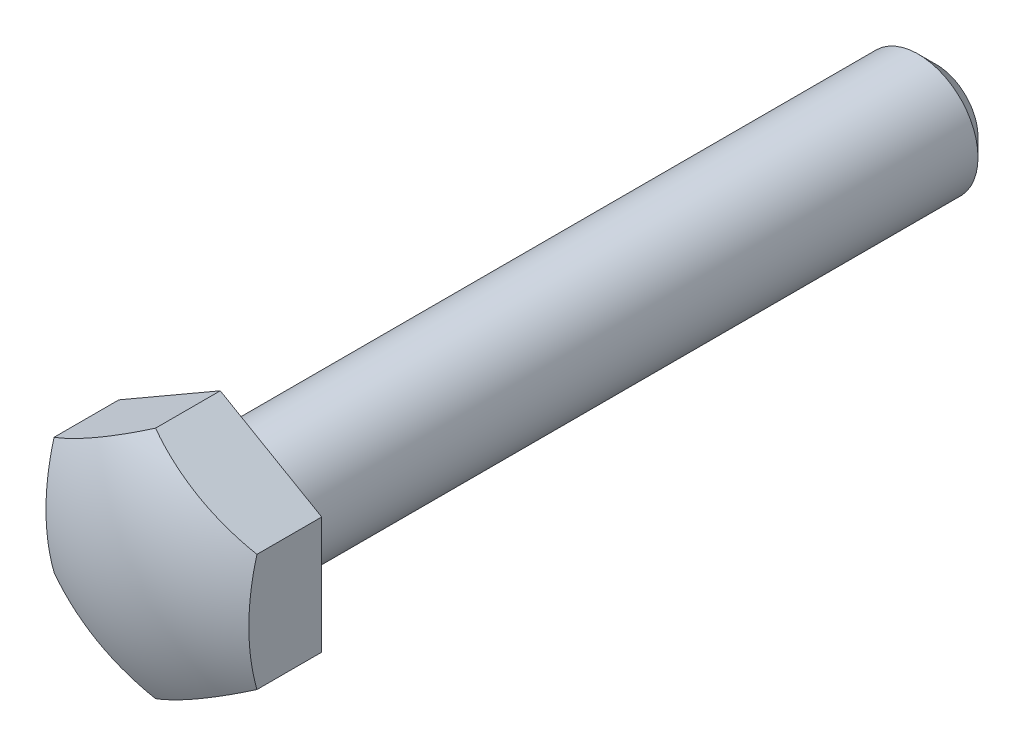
ISO-10303-21;
HEADER;
FILE_DESCRIPTION(('STEP AP214'),'2;1');
FILE_NAME('part.step','',(''),(''),'','','');
FILE_SCHEMA(('AUTOMOTIVE_DESIGN { 1 0 10303 214 1 1 1 1 }'));
ENDSEC;
DATA;
#1=APPLICATION_CONTEXT('core data for automotive mechanical design processes');
#2=APPLICATION_PROTOCOL_DEFINITION('international standard','automotive_design',2000,#1);
#3=PRODUCT_CONTEXT('',#1,'mechanical');
#4=PRODUCT('Part','Part','',(#3));
#5=PRODUCT_RELATED_PRODUCT_CATEGORY('part','',(#4));
#6=PRODUCT_DEFINITION_FORMATION('','',#4);
#7=PRODUCT_DEFINITION_CONTEXT('part definition',#1,'design');
#8=PRODUCT_DEFINITION('design','',#6,#7);
#9=PRODUCT_DEFINITION_SHAPE('','',#8);
#10=(LENGTH_UNIT() NAMED_UNIT(*) SI_UNIT(.MILLI.,.METRE.));
#11=(NAMED_UNIT(*) PLANE_ANGLE_UNIT() SI_UNIT($,.RADIAN.));
#12=(NAMED_UNIT(*) SI_UNIT($,.STERADIAN.) SOLID_ANGLE_UNIT());
#13=UNCERTAINTY_MEASURE_WITH_UNIT(LENGTH_MEASURE(1.E-05),#10,'distance_accuracy_value','');
#14=(GEOMETRIC_REPRESENTATION_CONTEXT(3) GLOBAL_UNCERTAINTY_ASSIGNED_CONTEXT((#13)) GLOBAL_UNIT_ASSIGNED_CONTEXT((#10,
#11,#12)) REPRESENTATION_CONTEXT('',''));
#15=CARTESIAN_POINT('',(0.,0.,0.));
#16=DIRECTION('',(0.,0.,1.));
#17=DIRECTION('',(1.,0.,0.));
#18=AXIS2_PLACEMENT_3D('',#15,#16,#17);
#19=CARTESIAN_POINT('',(5.,0.,0.));
#20=DIRECTION('',(0.,0.,1.));
#21=DIRECTION('',(1.,0.,0.));
#22=AXIS2_PLACEMENT_3D('',#19,#20,#21);
#23=PLANE('',#22);
#24=CARTESIAN_POINT('',(0.,0.,0.));
#25=DIRECTION('',(0.,0.,1.));
#26=DIRECTION('',(1.,0.,0.));
#27=AXIS2_PLACEMENT_3D('',#24,#25,#26);
#28=CIRCLE('',#27,5.);
#29=CARTESIAN_POINT('',(5.,0.,0.));
#30=VERTEX_POINT('',#29);
#31=EDGE_CURVE('E115',#30,#30,#28,.T.);
#32=ORIENTED_EDGE('',*,*,#31,.T.);
#33=EDGE_LOOP('',(#32));
#34=FACE_BOUND('',#33,.T.);
#35=DIRECTION('',(-0.86602540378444,-0.5,0.));
#36=VECTOR('',#35,1.);
#37=CARTESIAN_POINT('',(8.5,-4.90747728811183,0.));
#38=LINE('',#37,#36);
#39=CARTESIAN_POINT('',(8.5,-4.90747728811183,0.));
#40=VERTEX_POINT('',#39);
#41=CARTESIAN_POINT('',(0.,-9.81495457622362,0.));
#42=VERTEX_POINT('',#41);
#43=EDGE_CURVE('E89',#40,#42,#38,.T.);
#44=ORIENTED_EDGE('',*,*,#43,.T.);
#45=DIRECTION('',(0.86602540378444,-0.5,0.));
#46=VECTOR('',#45,1.);
#47=CARTESIAN_POINT('',(-8.5,-4.90747728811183,0.));
#48=LINE('',#47,#46);
#49=CARTESIAN_POINT('',(-8.5,-4.90747728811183,0.));
#50=VERTEX_POINT('',#49);
#51=EDGE_CURVE('E87',#50,#42,#48,.T.);
#52=ORIENTED_EDGE('',*,*,#51,.F.);
#53=DIRECTION('',(0.,-1.,0.));
#54=VECTOR('',#53,1.);
#55=CARTESIAN_POINT('',(-8.5,4.9074772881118,0.));
#56=LINE('',#55,#54);
#57=CARTESIAN_POINT('',(-8.5,4.9074772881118,0.));
#58=VERTEX_POINT('',#57);
#59=EDGE_CURVE('E37',#58,#50,#56,.T.);
#60=ORIENTED_EDGE('',*,*,#59,.F.);
#61=DIRECTION('',(0.866025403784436,0.5,0.));
#62=VECTOR('',#61,1.);
#63=CARTESIAN_POINT('',(-8.5,4.9074772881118,0.));
#64=LINE('',#63,#62);
#65=CARTESIAN_POINT('',(0.,9.81495457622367,0.));
#66=VERTEX_POINT('',#65);
#67=EDGE_CURVE('E77',#58,#66,#64,.T.);
#68=ORIENTED_EDGE('',*,*,#67,.T.);
#69=DIRECTION('',(-0.866025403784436,0.5,0.));
#70=VECTOR('',#69,1.);
#71=CARTESIAN_POINT('',(8.5,4.90747728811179,0.));
#72=LINE('',#71,#70);
#73=CARTESIAN_POINT('',(8.5,4.90747728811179,0.));
#74=VERTEX_POINT('',#73);
#75=EDGE_CURVE('E83',#74,#66,#72,.T.);
#76=ORIENTED_EDGE('',*,*,#75,.F.);
#77=DIRECTION('',(0.,-1.,0.));
#78=VECTOR('',#77,1.);
#79=CARTESIAN_POINT('',(8.5,4.90747728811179,0.));
#80=LINE('',#79,#78);
#81=EDGE_CURVE('E95',#74,#40,#80,.T.);
#82=ORIENTED_EDGE('',*,*,#81,.T.);
#83=EDGE_LOOP('',(#44,#52,#60,#68,#76,#82));
#84=FACE_BOUND('',#83,.T.);
#85=ADVANCED_FACE('F14',(#34,#84),#23,.F.);
#86=CARTESIAN_POINT('',(0.,0.,0.));
#87=DIRECTION('',(0.,0.,1.));
#88=DIRECTION('',(1.,0.,0.));
#89=AXIS2_PLACEMENT_3D('',#86,#87,#88);
#90=CYLINDRICAL_SURFACE('',#89,5.);
#91=CARTESIAN_POINT('',(0.,0.,-58.5));
#92=DIRECTION('',(0.,0.,1.));
#93=DIRECTION('',(1.,0.,0.));
#94=AXIS2_PLACEMENT_3D('',#91,#92,#93);
#95=CIRCLE('',#94,5.);
#96=CARTESIAN_POINT('',(5.,0.,-58.5));
#97=VERTEX_POINT('',#96);
#98=EDGE_CURVE('E22',#97,#97,#95,.T.);
#99=ORIENTED_EDGE('',*,*,#98,.T.);
#100=EDGE_LOOP('',(#99));
#101=FACE_BOUND('',#100,.T.);
#102=ORIENTED_EDGE('',*,*,#31,.F.);
#103=EDGE_LOOP('',(#102));
#104=FACE_BOUND('',#103,.T.);
#105=ADVANCED_FACE('F120',(#101,#104),#90,.T.);
#106=CARTESIAN_POINT('',(0.,0.,-60.));
#107=DIRECTION('',(0.,0.,1.));
#108=DIRECTION('',(1.,0.,0.));
#109=AXIS2_PLACEMENT_3D('',#106,#107,#108);
#110=PLANE('',#109);
#111=CARTESIAN_POINT('',(0.,0.,-60.));
#112=DIRECTION('',(0.,0.,1.));
#113=DIRECTION('',(1.,0.,0.));
#114=AXIS2_PLACEMENT_3D('',#111,#112,#113);
#115=CIRCLE('',#114,3.5);
#116=CARTESIAN_POINT('',(3.5,0.,-60.));
#117=VERTEX_POINT('',#116);
#118=EDGE_CURVE('E9',#117,#117,#115,.F.);
#119=ORIENTED_EDGE('',*,*,#118,.T.);
#120=EDGE_LOOP('',(#119));
#121=FACE_BOUND('',#120,.T.);
#122=ADVANCED_FACE('F141',(#121),#110,.F.);
#123=CARTESIAN_POINT('',(8.5,-4.90747728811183,8.));
#124=DIRECTION('',(0.5,-0.86602540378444,0.));
#125=DIRECTION('',(0.86602540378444,0.5,0.));
#126=AXIS2_PLACEMENT_3D('',#123,#124,#125);
#127=PLANE('',#126);
#128=DIRECTION('',(0.,0.,-1.));
#129=VECTOR('',#128,1.);
#130=CARTESIAN_POINT('',(0.,-9.81495457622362,8.));
#131=LINE('',#130,#129);
#132=CARTESIAN_POINT('',(0.,-9.81495457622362,5.42603416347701));
#133=VERTEX_POINT('',#132);
#134=EDGE_CURVE('E29',#133,#42,#131,.T.);
#135=ORIENTED_EDGE('',*,*,#134,.T.);
#136=ORIENTED_EDGE('',*,*,#43,.F.);
#137=DIRECTION('',(0.,0.,-1.));
#138=VECTOR('',#137,1.);
#139=CARTESIAN_POINT('',(8.5,-4.90747728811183,8.));
#140=LINE('',#139,#138);
#141=CARTESIAN_POINT('',(8.5,-4.90747728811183,5.42603416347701));
#142=VERTEX_POINT('',#141);
#143=EDGE_CURVE('E100',#142,#40,#140,.T.);
#144=ORIENTED_EDGE('',*,*,#143,.F.);
#145=CARTESIAN_POINT('',(4.25,-7.36121593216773,-12.));
#146=DIRECTION('',(0.5,-0.86602540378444,0.));
#147=DIRECTION('',(0.86602540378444,0.5,0.));
#148=AXIS2_PLACEMENT_3D('',#145,#146,#147);
#149=CIRCLE('',#148,18.1038669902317);
#150=EDGE_CURVE('E112',#133,#142,#149,.F.);
#151=ORIENTED_EDGE('',*,*,#150,.F.);
#152=EDGE_LOOP('',(#135,#136,#144,#151));
#153=FACE_BOUND('',#152,.T.);
#154=ADVANCED_FACE('F146',(#153),#127,.T.);
#155=CARTESIAN_POINT('',(8.5,4.90747728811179,8.));
#156=DIRECTION('',(1.,0.,0.));
#157=DIRECTION('',(0.,0.,-1.));
#158=AXIS2_PLACEMENT_3D('',#155,#156,#157);
#159=PLANE('',#158);
#160=ORIENTED_EDGE('',*,*,#143,.T.);
#161=ORIENTED_EDGE('',*,*,#81,.F.);
#162=DIRECTION('',(0.,0.,-1.));
#163=VECTOR('',#162,1.);
#164=CARTESIAN_POINT('',(8.5,4.90747728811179,8.));
#165=LINE('',#164,#163);
#166=CARTESIAN_POINT('',(8.5,4.90747728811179,5.42603416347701));
#167=VERTEX_POINT('',#166);
#168=EDGE_CURVE('E98',#167,#74,#165,.T.);
#169=ORIENTED_EDGE('',*,*,#168,.F.);
#170=CARTESIAN_POINT('',(8.5,0.,-12.));
#171=DIRECTION('',(1.,0.,0.));
#172=DIRECTION('',(0.,0.,-1.));
#173=AXIS2_PLACEMENT_3D('',#170,#171,#172);
#174=CIRCLE('',#173,18.1038669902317);
#175=EDGE_CURVE('E109',#142,#167,#174,.F.);
#176=ORIENTED_EDGE('',*,*,#175,.F.);
#177=EDGE_LOOP('',(#160,#161,#169,#176));
#178=FACE_BOUND('',#177,.T.);
#179=ADVANCED_FACE('F148',(#178),#159,.T.);
#180=CARTESIAN_POINT('',(8.5,4.90747728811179,8.));
#181=DIRECTION('',(-0.5,-0.866025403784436,0.));
#182=DIRECTION('',(0.866025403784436,-0.5,0.));
#183=AXIS2_PLACEMENT_3D('',#180,#181,#182);
#184=PLANE('',#183);
#185=CARTESIAN_POINT('',(4.25,7.36121593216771,-12.));
#186=DIRECTION('',(-0.5,-0.866025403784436,0.));
#187=DIRECTION('',(0.866025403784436,-0.5,0.));
#188=AXIS2_PLACEMENT_3D('',#185,#186,#187);
#189=CIRCLE('',#188,18.1038669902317);
#190=CARTESIAN_POINT('',(0.,9.81495457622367,5.42603416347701));
#191=VERTEX_POINT('',#190);
#192=EDGE_CURVE('E107',#191,#167,#189,.F.);
#193=ORIENTED_EDGE('',*,*,#192,.T.);
#194=ORIENTED_EDGE('',*,*,#168,.T.);
#195=ORIENTED_EDGE('',*,*,#75,.T.);
#196=DIRECTION('',(0.,0.,-1.));
#197=VECTOR('',#196,1.);
#198=CARTESIAN_POINT('',(0.,9.81495457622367,8.));
#199=LINE('',#198,#197);
#200=EDGE_CURVE('E73',#191,#66,#199,.T.);
#201=ORIENTED_EDGE('',*,*,#200,.F.);
#202=EDGE_LOOP('',(#193,#194,#195,#201));
#203=FACE_BOUND('',#202,.T.);
#204=ADVANCED_FACE('F151',(#203),#184,.F.);
#205=CARTESIAN_POINT('',(-8.5,4.9074772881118,8.));
#206=DIRECTION('',(-0.5,0.866025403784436,0.));
#207=DIRECTION('',(-0.866025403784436,-0.5,0.));
#208=AXIS2_PLACEMENT_3D('',#205,#206,#207);
#209=PLANE('',#208);
#210=ORIENTED_EDGE('',*,*,#200,.T.);
#211=ORIENTED_EDGE('',*,*,#67,.F.);
#212=DIRECTION('',(0.,0.,-1.));
#213=VECTOR('',#212,1.);
#214=CARTESIAN_POINT('',(-8.5,4.9074772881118,8.));
#215=LINE('',#214,#213);
#216=CARTESIAN_POINT('',(-8.5,4.9074772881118,5.42603416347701));
#217=VERTEX_POINT('',#216);
#218=EDGE_CURVE('E66',#217,#58,#215,.T.);
#219=ORIENTED_EDGE('',*,*,#218,.F.);
#220=CARTESIAN_POINT('',(-4.25,7.36121593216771,-12.));
#221=DIRECTION('',(-0.5,0.866025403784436,0.));
#222=DIRECTION('',(-0.866025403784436,-0.5,0.));
#223=AXIS2_PLACEMENT_3D('',#220,#221,#222);
#224=CIRCLE('',#223,18.1038669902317);
#225=EDGE_CURVE('E105',#191,#217,#224,.F.);
#226=ORIENTED_EDGE('',*,*,#225,.F.);
#227=EDGE_LOOP('',(#210,#211,#219,#226));
#228=FACE_BOUND('',#227,.T.);
#229=ADVANCED_FACE('F78',(#228),#209,.T.);
#230=CARTESIAN_POINT('',(-8.5,4.9074772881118,8.));
#231=DIRECTION('',(1.,0.,0.));
#232=DIRECTION('',(0.,1.,0.));
#233=AXIS2_PLACEMENT_3D('',#230,#231,#232);
#234=PLANE('',#233);
#235=CARTESIAN_POINT('',(-8.5,0.,-12.));
#236=DIRECTION('',(1.,0.,0.));
#237=DIRECTION('',(0.,1.,0.));
#238=AXIS2_PLACEMENT_3D('',#235,#236,#237);
#239=CIRCLE('',#238,18.1038669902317);
#240=CARTESIAN_POINT('',(-8.5,-4.90747728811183,5.42603416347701));
#241=VERTEX_POINT('',#240);
#242=EDGE_CURVE('E70',#241,#217,#239,.F.);
#243=ORIENTED_EDGE('',*,*,#242,.T.);
#244=ORIENTED_EDGE('',*,*,#218,.T.);
#245=ORIENTED_EDGE('',*,*,#59,.T.);
#246=DIRECTION('',(0.,0.,-1.));
#247=VECTOR('',#246,1.);
#248=CARTESIAN_POINT('',(-8.5,-4.90747728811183,8.));
#249=LINE('',#248,#247);
#250=EDGE_CURVE('E74',#241,#50,#249,.T.);
#251=ORIENTED_EDGE('',*,*,#250,.F.);
#252=EDGE_LOOP('',(#243,#244,#245,#251));
#253=FACE_BOUND('',#252,.T.);
#254=ADVANCED_FACE('F68',(#253),#234,.F.);
#255=CARTESIAN_POINT('',(-8.5,-4.90747728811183,8.));
#256=DIRECTION('',(0.5,0.86602540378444,0.));
#257=DIRECTION('',(-0.86602540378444,0.5,0.));
#258=AXIS2_PLACEMENT_3D('',#255,#256,#257);
#259=PLANE('',#258);
#260=CARTESIAN_POINT('',(-4.25,-7.36121593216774,-12.));
#261=DIRECTION('',(0.5,0.86602540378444,0.));
#262=DIRECTION('',(-0.86602540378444,0.5,0.));
#263=AXIS2_PLACEMENT_3D('',#260,#261,#262);
#264=CIRCLE('',#263,18.1038669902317);
#265=EDGE_CURVE('E102',#133,#241,#264,.F.);
#266=ORIENTED_EDGE('',*,*,#265,.T.);
#267=ORIENTED_EDGE('',*,*,#250,.T.);
#268=ORIENTED_EDGE('',*,*,#51,.T.);
#269=ORIENTED_EDGE('',*,*,#134,.F.);
#270=EDGE_LOOP('',(#266,#267,#268,#269));
#271=FACE_BOUND('',#270,.T.);
#272=ADVANCED_FACE('F131',(#271),#259,.F.);
#273=CARTESIAN_POINT('',(0.,0.,-12.));
#274=DIRECTION('',(0.,0.,1.));
#275=DIRECTION('',(1.,0.,0.));
#276=AXIS2_PLACEMENT_3D('',#273,#274,#275);
#277=SPHERICAL_SURFACE('',#276,20.);
#278=ORIENTED_EDGE('',*,*,#265,.F.);
#279=ORIENTED_EDGE('',*,*,#150,.T.);
#280=ORIENTED_EDGE('',*,*,#175,.T.);
#281=ORIENTED_EDGE('',*,*,#192,.F.);
#282=ORIENTED_EDGE('',*,*,#225,.T.);
#283=ORIENTED_EDGE('',*,*,#242,.F.);
#284=EDGE_LOOP('',(#278,#279,#280,#281,#282,#283));
#285=FACE_BOUND('',#284,.T.);
#286=ADVANCED_FACE('F124',(#285),#277,.T.);
#287=CARTESIAN_POINT('',(0.,0.,-58.5));
#288=DIRECTION('',(0.,0.,1.));
#289=DIRECTION('',(1.,0.,0.));
#290=AXIS2_PLACEMENT_3D('',#287,#288,#289);
#291=CONICAL_SURFACE('',#290,5.,0.785398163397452);
#292=ORIENTED_EDGE('',*,*,#118,.F.);
#293=EDGE_LOOP('',(#292));
#294=FACE_BOUND('',#293,.T.);
#295=ORIENTED_EDGE('',*,*,#98,.F.);
#296=EDGE_LOOP('',(#295));
#297=FACE_BOUND('',#296,.T.);
#298=ADVANCED_FACE('F16',(#294,#297),#291,.T.);
#299=CLOSED_SHELL('',(#85,#105,#122,#154,#179,#204,#229,#254,#272,#286,#298));
#300=MANIFOLD_SOLID_BREP('B1',#299);
#301=ADVANCED_BREP_SHAPE_REPRESENTATION('',(#18,#300),#14);
#302=SHAPE_DEFINITION_REPRESENTATION(#9,#301);
ENDSEC;
END-ISO-10303-21;
